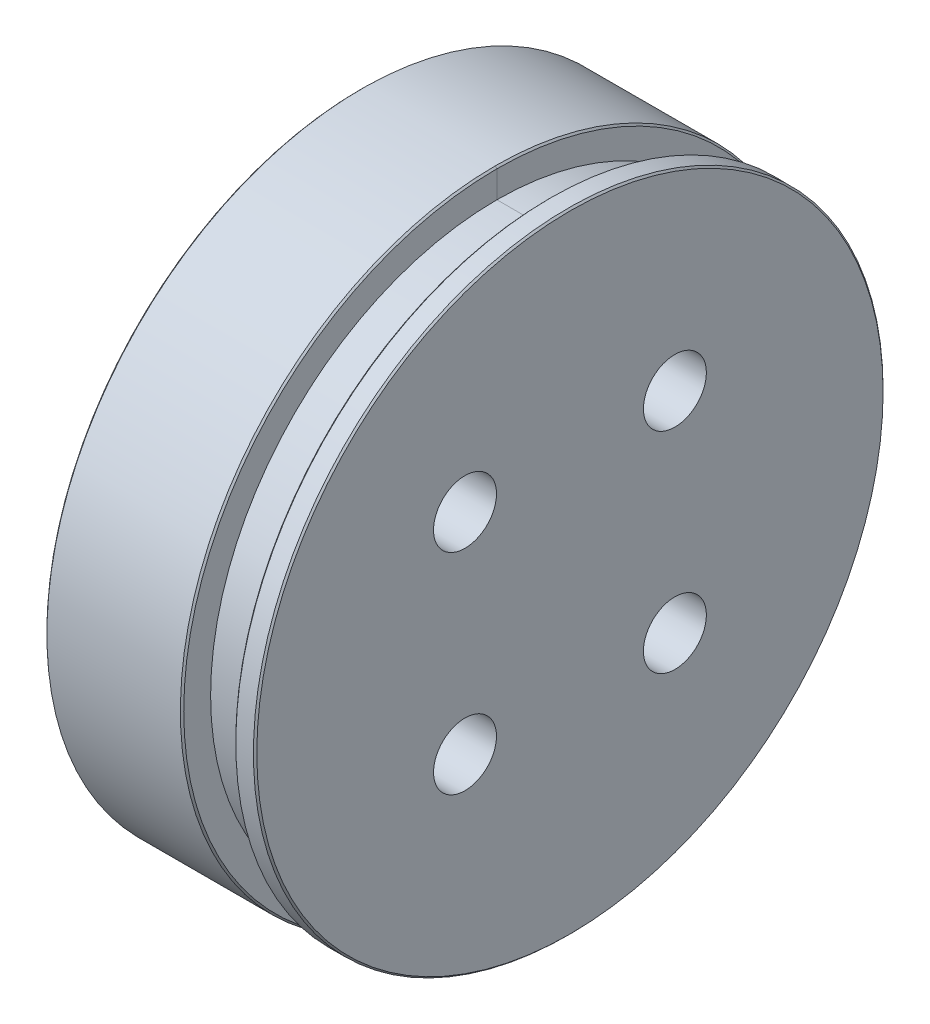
from build123d import *

# Parameters (mm, degrees)
SKETCH1_R           = 47.625
BOSS_EXTRUDE1_DEPTH = 31.75
SKETCH6_R           = 3.96875
CUT_EXTRUDE3_DEPTH  = 15.875
SKETCH7_R           = 4.7625
CUT_EXTRUDE4_DEPTH  = 75.460350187
SKETCH8_W           = 7.874
SKETCH8_H           = 4.318
CHAMFER2_SIZE       = 0.254


with BuildPart() as part:
    # Sketch1 → Boss-Extrude1 (new body)
    with BuildSketch(Plane(origin=(0, 0, 0), x_dir=(0, 0, -1), z_dir=(1, 0, 0))):
        Circle(SKETCH1_R)
    extrude(amount=-BOSS_EXTRUDE1_DEPTH)

    # Sketch6 → Cut-Extrude3 (cut)
    with BuildSketch(Plane.ZY.offset(31.75)):
        with Locations((26.940768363, 26.940768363)):
            Circle(SKETCH6_R)
        with Locations((0, 38.1)):
            Circle(SKETCH6_R)
        with Locations((38.1, 0)):
            Circle(SKETCH6_R)
        with Locations((0, -38.1)):
            Circle(SKETCH6_R)
        with Locations((-38.1, 0)):
            Circle(SKETCH6_R)
        with Locations((26.940768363, -26.940768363)):
            Circle(SKETCH6_R)
        with Locations((-26.940768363, -26.940768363)):
            Circle(SKETCH6_R)
        with Locations((-26.940768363, 26.940768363)):
            Circle(SKETCH6_R)
    extrude(amount=-CUT_EXTRUDE3_DEPTH, mode=Mode.SUBTRACT)

    # Sketch7 → Cut-Extrude4 (cut, through all)
    with BuildSketch(Plane(origin=(0, 0, 0), x_dir=(0, 0, -1), z_dir=(1, 0, 0))):
        with Locations((15.875, 15.875)):
            Circle(SKETCH7_R)
        with Locations((-15.875, 15.875)):
            Circle(SKETCH7_R)
        with Locations((-15.875, -15.875)):
            Circle(SKETCH7_R)
        with Locations((15.875, -15.875)):
            Circle(SKETCH7_R)
    extrude(amount=-CUT_EXTRUDE4_DEPTH, mode=Mode.SUBTRACT)

    # Cut-Sweep1: sweep along a curve in space
    with BuildLine() as cut_sweep1_path:
        ThreePointArc((0, 0, -47.625), (0, 33.675960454, -33.675960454), (0, 47.625, 0))
        ThreePointArc((0, 47.625, 0), (0, 33.675960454, 33.675960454), (0, 0, 47.625))
        ThreePointArc((0, 0, 47.625), (0, -33.675960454, 33.675960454), (0, -47.625, 0))
        ThreePointArc((0, -47.625, 0), (0, -33.675960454, -33.675960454), (0, 0, -47.625))
    # Sketch8 → Cut-Sweep1 (sweep, cut)
    with BuildSketch(Plane.XY):
        with Locations((-7.112, 45.466)):
            Rectangle(SKETCH8_W, SKETCH8_H)
    sweep(path=cut_sweep1_path.line, mode=Mode.SUBTRACT)

    # Chamfer2
    chamfer2_edges = [part.edges().sort_by_distance(p)[0] for p in [
        (0, 0, 47.625),
        (-31.75, 0, 47.625),
        (-11.049, 0, 47.625),
        (-11.049, 0, 47.625),
        (-3.175, 0, 47.625),
        (-3.175, 0, 47.625),
    ]]
    chamfer(chamfer2_edges, length=CHAMFER2_SIZE)


solid = part.part
